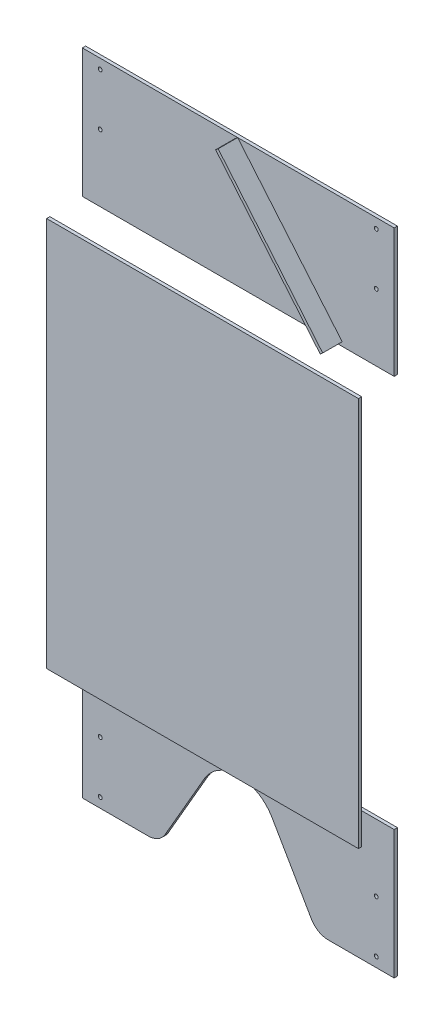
from build123d import *

# Parameters (mm, degrees)
SKIZZE1_R                       = 3
LINEAR_AUSTRAGEN1_DEPTH         = 5
SCHNITT_LINEAR_AUSTRAGEN1_DEPTH = 1029.408965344
LINEAR_AUSTRAGEN2_DEPTH         = 30


with BuildPart() as part:
    # Skizze1 → Linear austragen1 (new body)
    with BuildSketch(Plane.XY):
        with BuildLine():
            Line((240, 0), (-240, 0))
            Line((-240, 0), (-240, -1000))
            Line((-240, -1000), (-138.564064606, -1000))
            ThreePointArc((-138.564064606, -1000), (-123.564064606, -995.980762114), (-112.583302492, -985))
            Line((-112.583302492, -985), (-51.961524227, -880))
            ThreePointArc((-51.961524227, -880), (0, -850), (51.961524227, -880))
            Line((51.961524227, -880), (112.583302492, -985))
            ThreePointArc((112.583302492, -985), (123.564064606, -995.980762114), (138.564064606, -1000))
            Line((138.564064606, -1000), (240, -1000))
            Line((240, -1000), (240, 0))
        make_face()
        with Locations((212.5, -905)):
            Circle(SKIZZE1_R, mode=Mode.SUBTRACT)
        with Locations((212.5, -985)):
            Circle(SKIZZE1_R, mode=Mode.SUBTRACT)
        with Locations((-212.5, -905)):
            Circle(SKIZZE1_R, mode=Mode.SUBTRACT)
        with Locations((-212.5, -985)):
            Circle(SKIZZE1_R, mode=Mode.SUBTRACT)
        with Locations((212.5, -95)):
            Circle(SKIZZE1_R, mode=Mode.SUBTRACT)
        with Locations((212.5, -15)):
            Circle(SKIZZE1_R, mode=Mode.SUBTRACT)
        with Locations((-212.5, -95)):
            Circle(SKIZZE1_R, mode=Mode.SUBTRACT)
        with Locations((-212.5, -15)):
            Circle(SKIZZE1_R, mode=Mode.SUBTRACT)
    extrude(amount=-LINEAR_AUSTRAGEN1_DEPTH)

    # Skizze4 → Schnitt-Linear austragen1 (cut, through all)
    with BuildSketch(Plane(origin=(0, 0, -5), x_dir=(-1, 0, 0), z_dir=(0, 0, -1))):
        Polygon((348, -802), (-302, -802), (-302, -198), (348, -198), (348, -200), (-300, -200), (-300, -800), (348, -800), align=None)
    extrude(amount=-SCHNITT_LINEAR_AUSTRAGEN1_DEPTH, mode=Mode.SUBTRACT)


with BuildPart() as schnitt_linear_austragen1_piece_1:
    # of the separate pieces the step leaves, piece 1, a body of its own (schnitt_linear_austragen1_pieces)
    add(part.part.solids().sort_by_distance((240, -800, 0))[0])


with BuildPart() as schnitt_linear_austragen1_piece_2:
    # of the separate pieces the step leaves, piece 2, a body of its own (schnitt_linear_austragen1_pieces)
    add(part.part.solids().sort_by_distance((240, 0, 0))[0])


with BuildPart() as schnitt_linear_austragen1_piece_3:
    # of the separate pieces the step leaves, piece 3, a body of its own (schnitt_linear_austragen1_pieces)
    add(part.part.solids().sort_by_distance((240, -1000, 0))[0])


with BuildPart() as schnitt_linear_austragen1_piece_2_1:
    # K_rper-Verschieben_Kopieren1: moved
    add(schnitt_linear_austragen1_piece_2.part.moved(Location((0, 0, -55))))

    # Skizze5 → Linear austragen2 (add)
    with BuildSketch(Plane.XY.offset(-55)):
        Polygon((-0.927613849, 0), (160, -191.786061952), (156.169777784, -195), (-4.757836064, -3.213938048), align=None)
    extrude(amount=LINEAR_AUSTRAGEN2_DEPTH)


with BuildPart() as schnitt_linear_austragen1_piece_3_1:
    # K_rper-Verschieben_Kopieren1: moved
    add(schnitt_linear_austragen1_piece_3.part.moved(Location((0, 0, -55))))


solid = Compound([schnitt_linear_austragen1_piece_1.part, schnitt_linear_austragen1_piece_2_1.part, schnitt_linear_austragen1_piece_3_1.part])
